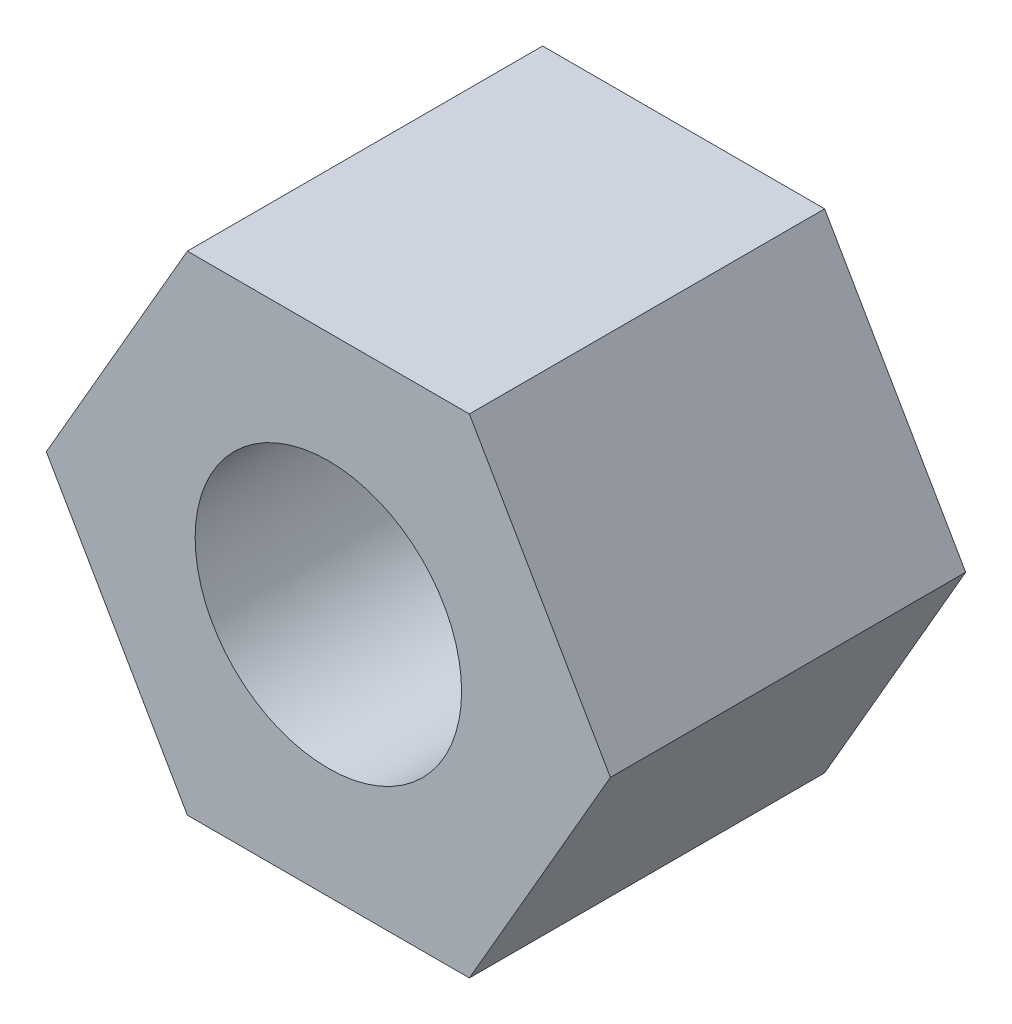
from build123d import *

# Parameters (mm, degrees)
SKETCH_1_R                     = 1.5
NYLOCK_EXTERNAL_ENVELOPE_DEPTH = 4


with BuildPart() as part:
    # Sketch 1 → Nylock_external_envelope (new body)
    with BuildSketch(Plane.XY):
        Polygon((3.175426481, 0), (1.58771324, 2.75), (-1.58771324, 2.75), (-3.175426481, 0), (-1.58771324, -2.75), (1.58771324, -2.75), align=None)
        Circle(SKETCH_1_R, mode=Mode.SUBTRACT)
    extrude(amount=NYLOCK_EXTERNAL_ENVELOPE_DEPTH)


solid = part.part
